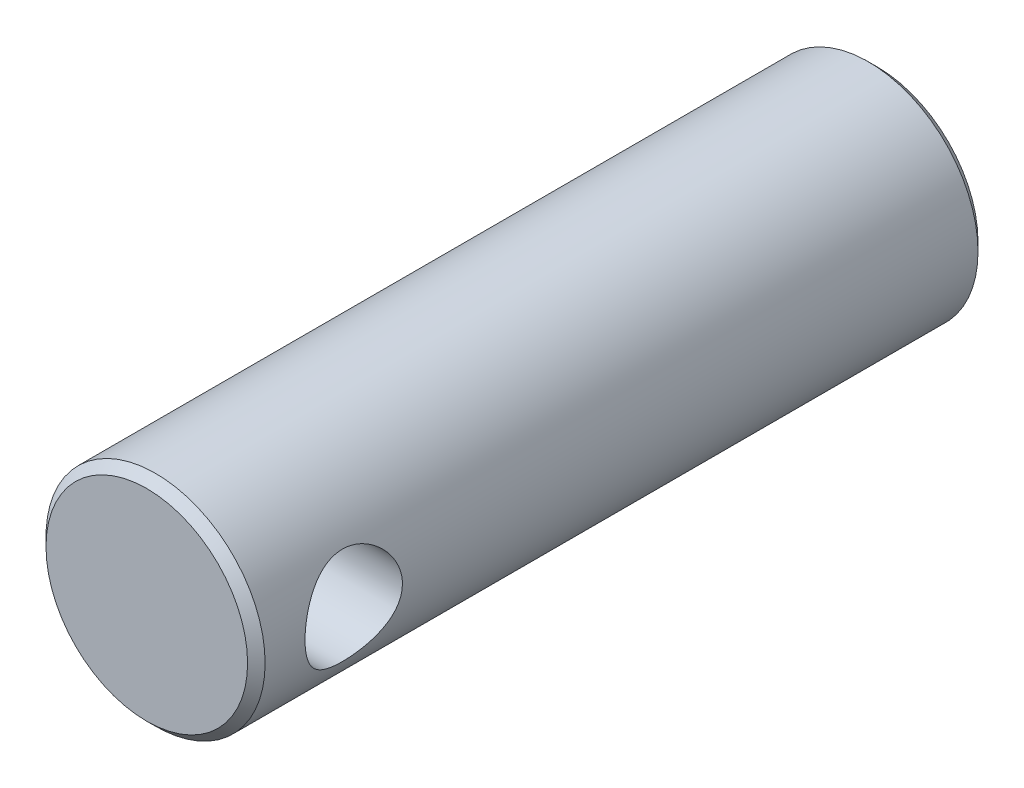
ISO-10303-21;
HEADER;
FILE_DESCRIPTION(('STEP AP214'),'2;1');
FILE_NAME('part.step','',(''),(''),'','','');
FILE_SCHEMA(('AUTOMOTIVE_DESIGN { 1 0 10303 214 1 1 1 1 }'));
ENDSEC;
DATA;
#1=APPLICATION_CONTEXT('core data for automotive mechanical design processes');
#2=APPLICATION_PROTOCOL_DEFINITION('international standard','automotive_design',2000,#1);
#3=PRODUCT_CONTEXT('',#1,'mechanical');
#4=PRODUCT('Part','Part','',(#3));
#5=PRODUCT_RELATED_PRODUCT_CATEGORY('part','',(#4));
#6=PRODUCT_DEFINITION_FORMATION('','',#4);
#7=PRODUCT_DEFINITION_CONTEXT('part definition',#1,'design');
#8=PRODUCT_DEFINITION('design','',#6,#7);
#9=PRODUCT_DEFINITION_SHAPE('','',#8);
#10=(LENGTH_UNIT() NAMED_UNIT(*) SI_UNIT(.MILLI.,.METRE.));
#11=(NAMED_UNIT(*) PLANE_ANGLE_UNIT() SI_UNIT($,.RADIAN.));
#12=(NAMED_UNIT(*) SI_UNIT($,.STERADIAN.) SOLID_ANGLE_UNIT());
#13=UNCERTAINTY_MEASURE_WITH_UNIT(LENGTH_MEASURE(1.E-05),#10,'distance_accuracy_value','');
#14=(GEOMETRIC_REPRESENTATION_CONTEXT(3) GLOBAL_UNCERTAINTY_ASSIGNED_CONTEXT((#13)) GLOBAL_UNIT_ASSIGNED_CONTEXT((#10,
#11,#12)) REPRESENTATION_CONTEXT('',''));
#15=CARTESIAN_POINT('',(0.,0.,0.));
#16=DIRECTION('',(0.,0.,1.));
#17=DIRECTION('',(1.,0.,0.));
#18=AXIS2_PLACEMENT_3D('',#15,#16,#17);
#19=CARTESIAN_POINT('',(0.,0.,0.));
#20=DIRECTION('',(0.,0.,-1.));
#21=DIRECTION('',(1.,0.,0.));
#22=AXIS2_PLACEMENT_3D('',#19,#20,#21);
#23=CYLINDRICAL_SURFACE('',#22,9.);
#24=CARTESIAN_POINT('',(9.,0.,56.));
#25=CARTESIAN_POINT('',(8.99999931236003,0.106543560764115,55.9999991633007));
#26=CARTESIAN_POINT('',(8.99810295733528,0.213114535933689,55.995737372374));
#27=CARTESIAN_POINT('',(8.99056534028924,0.425487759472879,55.9787335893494));
#28=CARTESIAN_POINT('',(8.9849219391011,0.531289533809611,55.9659867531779));
#29=CARTESIAN_POINT('',(8.97002203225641,0.741497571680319,55.9321151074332));
#30=CARTESIAN_POINT('',(8.96075877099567,0.845900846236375,55.9109746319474));
#31=CARTESIAN_POINT('',(8.93886560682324,1.0523739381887,55.8605472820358));
#32=CARTESIAN_POINT('',(8.92623432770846,1.15444278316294,55.8312570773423));
#33=CARTESIAN_POINT('',(8.88385509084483,1.45528706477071,55.731826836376));
#34=CARTESIAN_POINT('',(8.84954694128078,1.64969223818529,55.6499645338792));
#35=CARTESIAN_POINT('',(8.77205693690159,2.02169397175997,55.457842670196));
#36=CARTESIAN_POINT('',(8.72887710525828,2.19929435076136,55.3475895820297));
#37=CARTESIAN_POINT('',(8.63520005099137,2.54295194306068,55.095329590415));
#38=CARTESIAN_POINT('',(8.58444255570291,2.70796463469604,54.951994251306));
#39=CARTESIAN_POINT('',(8.48237167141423,3.01251193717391,54.6405139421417));
#40=CARTESIAN_POINT('',(8.43105797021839,3.15203136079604,54.4723542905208));
#41=CARTESIAN_POINT('',(8.33031613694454,3.40970641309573,54.1040790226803));
#42=CARTESIAN_POINT('',(8.28116793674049,3.52616342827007,53.9026789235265));
#43=CARTESIAN_POINT('',(8.21620901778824,3.67379855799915,53.5864416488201));
#44=CARTESIAN_POINT('',(8.1960107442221,3.71851343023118,53.478630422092));
#45=CARTESIAN_POINT('',(8.15924882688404,3.79849956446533,53.2589808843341));
#46=CARTESIAN_POINT('',(8.14268322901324,3.83377590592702,53.147144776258));
#47=CARTESIAN_POINT('',(8.11458487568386,3.89288163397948,52.9262099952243));
#48=CARTESIAN_POINT('',(8.1028347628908,3.91721191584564,52.8172725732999));
#49=CARTESIAN_POINT('',(8.08362129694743,3.95670961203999,52.5974216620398));
#50=CARTESIAN_POINT('',(8.07615587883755,3.9718814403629,52.4865091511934));
#51=CARTESIAN_POINT('',(8.06579894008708,3.99287182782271,52.2636277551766));
#52=CARTESIAN_POINT('',(8.06290582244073,3.99869365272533,52.1516592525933));
#53=CARTESIAN_POINT('',(8.06180452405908,4.00091360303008,51.9276108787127));
#54=CARTESIAN_POINT('',(8.06359604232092,3.99731233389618,51.8155310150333));
#55=CARTESIAN_POINT('',(8.07142338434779,3.98148137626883,51.6022728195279));
#56=CARTESIAN_POINT('',(8.07706352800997,3.9700557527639,51.5010195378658));
#57=CARTESIAN_POINT('',(8.09197245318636,3.9395760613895,51.2999289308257));
#58=CARTESIAN_POINT('',(8.10124240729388,3.92051952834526,51.2000920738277));
#59=CARTESIAN_POINT('',(8.13408651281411,3.85217674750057,50.9037623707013));
#60=CARTESIAN_POINT('',(8.16270181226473,3.79170447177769,50.7102821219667));
#61=CARTESIAN_POINT('',(8.23081734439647,3.64150006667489,50.332101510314));
#62=CARTESIAN_POINT('',(8.2705474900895,3.55114161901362,50.1476957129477));
#63=CARTESIAN_POINT('',(8.35638151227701,3.34416344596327,49.7958565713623));
#64=CARTESIAN_POINT('',(8.40248806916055,3.22753266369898,49.6284304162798));
#65=CARTESIAN_POINT('',(8.50133279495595,2.95801583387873,49.2981702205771));
#66=CARTESIAN_POINT('',(8.55427944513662,2.80270476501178,49.1373723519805));
#67=CARTESIAN_POINT('',(8.65709798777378,2.46687651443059,48.8433658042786));
#68=CARTESIAN_POINT('',(8.70696894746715,2.28635173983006,48.7101654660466));
#69=CARTESIAN_POINT('',(8.79984898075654,1.89830549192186,48.4715733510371));
#70=CARTESIAN_POINT('',(8.84261183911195,1.69014406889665,48.3671192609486));
#71=CARTESIAN_POINT('',(8.91451161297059,1.25681485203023,48.1954461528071));
#72=CARTESIAN_POINT('',(8.94365711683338,1.03165788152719,48.1282036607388));
#73=CARTESIAN_POINT('',(8.98336516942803,0.587641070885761,48.0373762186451));
#74=CARTESIAN_POINT('',(8.99508492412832,0.369442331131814,48.0110665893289));
#75=CARTESIAN_POINT('',(9.00240007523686,-0.0685540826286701,47.994593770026));
#76=CARTESIAN_POINT('',(8.9980009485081,-0.288351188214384,48.0044183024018));
#77=CARTESIAN_POINT('',(8.97430591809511,-0.709814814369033,48.0580870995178));
#78=CARTESIAN_POINT('',(8.95589038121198,-0.911792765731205,48.0999216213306));
#79=CARTESIAN_POINT('',(8.90701082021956,-1.30558421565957,48.2135161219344));
#80=CARTESIAN_POINT('',(8.87654533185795,-1.49739647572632,48.2852797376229));
#81=CARTESIAN_POINT('',(8.80524764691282,-1.87220783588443,48.4589771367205));
#82=CARTESIAN_POINT('',(8.76412168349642,-2.05474529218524,48.5617823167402));
#83=CARTESIAN_POINT('',(8.67576208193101,-2.40063957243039,48.7937052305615));
#84=CARTESIAN_POINT('',(8.62852578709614,-2.56398799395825,48.9228344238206));
#85=CARTESIAN_POINT('',(8.52825739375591,-2.8807303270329,49.2158239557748));
#86=CARTESIAN_POINT('',(8.4750650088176,-3.03226090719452,49.3816446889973));
#87=CARTESIAN_POINT('',(8.37207677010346,-3.30602071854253,49.7371478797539));
#88=CARTESIAN_POINT('',(8.32228212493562,-3.42823956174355,49.9268387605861));
#89=CARTESIAN_POINT('',(8.2540407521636,-3.5880743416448,50.228245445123));
#90=CARTESIAN_POINT('',(8.23214803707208,-3.63788387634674,50.3328797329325));
#91=CARTESIAN_POINT('',(8.19154569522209,-3.7284099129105,50.5465889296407));
#92=CARTESIAN_POINT('',(8.17283464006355,-3.76913049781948,50.6556618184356));
#93=CARTESIAN_POINT('',(8.13929816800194,-3.84101557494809,50.8774217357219));
#94=CARTESIAN_POINT('',(8.1244705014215,-3.87218560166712,50.9901066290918));
#95=CARTESIAN_POINT('',(8.09927719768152,-3.92460929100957,51.2182490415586));
#96=CARTESIAN_POINT('',(8.08891105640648,-3.94586407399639,51.3337062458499));
#97=CARTESIAN_POINT('',(8.07374935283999,-3.9767877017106,51.5564793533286));
#98=CARTESIAN_POINT('',(8.06855529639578,-3.98728755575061,51.6636534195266));
#99=CARTESIAN_POINT('',(8.06245450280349,-3.99960939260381,51.8786598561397));
#100=CARTESIAN_POINT('',(8.06154919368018,-4.00142848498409,51.9864924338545));
#101=CARTESIAN_POINT('',(8.06406616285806,-3.99635429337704,52.2018440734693));
#102=CARTESIAN_POINT('',(8.06748593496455,-3.98946605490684,52.309363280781));
#103=CARTESIAN_POINT('',(8.07851431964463,-3.96708318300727,52.5232976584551));
#104=CARTESIAN_POINT('',(8.08612450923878,-3.95158530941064,52.6297123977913));
#105=CARTESIAN_POINT('',(8.11370655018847,-3.89481025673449,52.9332533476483));
#106=CARTESIAN_POINT('',(8.13866591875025,-3.84284512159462,53.1280439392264));
#107=CARTESIAN_POINT('',(8.19957700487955,-3.71108221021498,53.5059989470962));
#108=CARTESIAN_POINT('',(8.23553189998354,-3.63127638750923,53.6891599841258));
#109=CARTESIAN_POINT('',(8.31722161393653,-3.4402432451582,54.0516647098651));
#110=CARTESIAN_POINT('',(8.36343549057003,-3.32733013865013,54.2300116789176));
#111=CARTESIAN_POINT('',(8.45929191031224,-3.07546946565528,54.5662532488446));
#112=CARTESIAN_POINT('',(8.50893588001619,-2.93651102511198,54.7241392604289));
#113=CARTESIAN_POINT('',(8.61126362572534,-2.622172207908,55.0292405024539));
#114=CARTESIAN_POINT('',(8.66383343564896,-2.44466910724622,55.1743141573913));
#115=CARTESIAN_POINT('',(8.76186799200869,-2.0658662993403,55.4328842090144));
#116=CARTESIAN_POINT('',(8.80732948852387,-1.86455578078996,55.546366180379));
#117=CARTESIAN_POINT('',(8.86614466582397,-1.55009155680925,55.6892195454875));
#118=CARTESIAN_POINT('',(8.88411858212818,-1.44376115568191,55.732125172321));
#119=CARTESIAN_POINT('',(8.91658812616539,-1.22735110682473,55.8087739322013));
#120=CARTESIAN_POINT('',(8.93108542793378,-1.11727329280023,55.8425214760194));
#121=CARTESIAN_POINT('',(8.95614098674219,-0.894475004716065,55.9004023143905));
#122=CARTESIAN_POINT('',(8.96670865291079,-0.781761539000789,55.9245585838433));
#123=CARTESIAN_POINT('',(8.9836293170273,-0.554414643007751,55.963066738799));
#124=CARTESIAN_POINT('',(8.98998524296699,-0.4397826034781,55.9774254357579));
#125=CARTESIAN_POINT('',(8.99608997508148,-0.270722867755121,55.9911961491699));
#126=CARTESIAN_POINT('',(8.99755504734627,-0.216644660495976,55.994496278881));
#127=CARTESIAN_POINT('',(8.99951024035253,-0.108380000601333,55.9988984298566));
#128=CARTESIAN_POINT('',(9.00000034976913,-0.0541935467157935,56.0000004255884));
#129=CARTESIAN_POINT('',(9.,0.,56.));
#130=B_SPLINE_CURVE_WITH_KNOTS('',3,(#24,#25,#26,#27,#28,#29,#30,#31,#32,#33,#34,#35,#36,#37,
#38,#39,#40,#41,#42,#43,#44,#45,#46,#47,#48,#49,#50,#51,#52,#53,#54,#55,#56,#57,#58,#59,#60,#61,
#62,#63,#64,#65,#66,#67,#68,#69,#70,#71,#72,#73,#74,#75,#76,#77,#78,#79,#80,#81,#82,#83,#84,#85,
#86,#87,#88,#89,#90,#91,#92,#93,#94,#95,#96,#97,#98,#99,#100,#101,#102,#103,#104,#105,#106,#107,
#108,#109,#110,#111,#112,#113,#114,#115,#116,#117,#118,#119,#120,#121,#122,#123,#124,#125,#126,
#127,#128,#129),.UNSPECIFIED.,.T.,.F.,(4,2,2,2,2,2,2,2,2,2,2,2,2,2,2,2,2,2,2,2,2,2,2,2,2,2,2,2,
2,2,2,2,2,2,2,2,2,2,2,2,2,2,2,2,2,2,2,2,2,2,2,2,4),(0.,0.319575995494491,0.639334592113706,
0.959692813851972,1.28018213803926,1.91817504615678,2.55602262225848,3.22626867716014,
3.89691272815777,4.60627839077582,4.9612246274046,5.31597945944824,5.65223953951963,
5.98833742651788,6.32431789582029,6.66027677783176,6.96605959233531,7.27194127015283,
7.88320420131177,8.50818797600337,9.13343527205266,9.81959120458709,10.5059542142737,
11.2125921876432,11.9187838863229,12.5755805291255,13.2321540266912,13.8505799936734,
14.4690811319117,15.1068781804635,15.7449534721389,16.4344546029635,17.1241997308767,
17.4776093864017,17.8308599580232,18.1839054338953,18.5369110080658,18.8599212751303,
19.183039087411,19.5059697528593,19.8290220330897,20.4355356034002,21.042224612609,
21.6877902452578,22.3336260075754,23.0359566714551,23.7386075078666,24.0863996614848,
24.4340240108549,24.7808105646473,25.1273557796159,25.2899067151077,25.4524595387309),.UNSPECIFIED.);
#131=CARTESIAN_POINT('',(9.,0.,56.));
#132=VERTEX_POINT('',#131);
#133=EDGE_CURVE('E30',#132,#132,#130,.T.);
#134=ORIENTED_EDGE('',*,*,#133,.T.);
#135=EDGE_LOOP('',(#134));
#136=FACE_BOUND('',#135,.T.);
#137=CARTESIAN_POINT('',(-9.,0.,56.));
#138=CARTESIAN_POINT('',(-8.99999931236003,-0.106543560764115,55.9999991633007));
#139=CARTESIAN_POINT('',(-8.99810295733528,-0.213114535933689,55.995737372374));
#140=CARTESIAN_POINT('',(-8.99056534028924,-0.425487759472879,55.9787335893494));
#141=CARTESIAN_POINT('',(-8.9849219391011,-0.531289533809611,55.9659867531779));
#142=CARTESIAN_POINT('',(-8.97002203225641,-0.741497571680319,55.9321151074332));
#143=CARTESIAN_POINT('',(-8.96075877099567,-0.845900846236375,55.9109746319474));
#144=CARTESIAN_POINT('',(-8.93886560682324,-1.0523739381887,55.8605472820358));
#145=CARTESIAN_POINT('',(-8.92623432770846,-1.15444278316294,55.8312570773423));
#146=CARTESIAN_POINT('',(-8.88385509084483,-1.45528706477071,55.731826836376));
#147=CARTESIAN_POINT('',(-8.84954694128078,-1.64969223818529,55.6499645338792));
#148=CARTESIAN_POINT('',(-8.77205693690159,-2.02169397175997,55.457842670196));
#149=CARTESIAN_POINT('',(-8.72887710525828,-2.19929435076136,55.3475895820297));
#150=CARTESIAN_POINT('',(-8.63520005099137,-2.54295194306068,55.095329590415));
#151=CARTESIAN_POINT('',(-8.58444255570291,-2.70796463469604,54.951994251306));
#152=CARTESIAN_POINT('',(-8.48237167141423,-3.01251193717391,54.6405139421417));
#153=CARTESIAN_POINT('',(-8.43105797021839,-3.15203136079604,54.4723542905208));
#154=CARTESIAN_POINT('',(-8.33031613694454,-3.40970641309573,54.1040790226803));
#155=CARTESIAN_POINT('',(-8.28116793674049,-3.52616342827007,53.9026789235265));
#156=CARTESIAN_POINT('',(-8.21620901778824,-3.67379855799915,53.5864416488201));
#157=CARTESIAN_POINT('',(-8.1960107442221,-3.71851343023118,53.478630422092));
#158=CARTESIAN_POINT('',(-8.15924882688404,-3.79849956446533,53.2589808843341));
#159=CARTESIAN_POINT('',(-8.14268322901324,-3.83377590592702,53.147144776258));
#160=CARTESIAN_POINT('',(-8.11458487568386,-3.89288163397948,52.9262099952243));
#161=CARTESIAN_POINT('',(-8.1028347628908,-3.91721191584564,52.8172725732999));
#162=CARTESIAN_POINT('',(-8.08362129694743,-3.95670961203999,52.5974216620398));
#163=CARTESIAN_POINT('',(-8.07615587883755,-3.9718814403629,52.4865091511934));
#164=CARTESIAN_POINT('',(-8.06579894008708,-3.99287182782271,52.2636277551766));
#165=CARTESIAN_POINT('',(-8.06290582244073,-3.99869365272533,52.1516592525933));
#166=CARTESIAN_POINT('',(-8.06180452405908,-4.00091360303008,51.9276108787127));
#167=CARTESIAN_POINT('',(-8.06359604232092,-3.99731233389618,51.8155310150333));
#168=CARTESIAN_POINT('',(-8.07142338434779,-3.98148137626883,51.6022728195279));
#169=CARTESIAN_POINT('',(-8.07706352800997,-3.9700557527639,51.5010195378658));
#170=CARTESIAN_POINT('',(-8.09197245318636,-3.9395760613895,51.2999289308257));
#171=CARTESIAN_POINT('',(-8.10124240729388,-3.92051952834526,51.2000920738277));
#172=CARTESIAN_POINT('',(-8.13408651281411,-3.85217674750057,50.9037623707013));
#173=CARTESIAN_POINT('',(-8.16270181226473,-3.79170447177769,50.7102821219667));
#174=CARTESIAN_POINT('',(-8.23081734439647,-3.64150006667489,50.332101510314));
#175=CARTESIAN_POINT('',(-8.2705474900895,-3.55114161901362,50.1476957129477));
#176=CARTESIAN_POINT('',(-8.35638151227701,-3.34416344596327,49.7958565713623));
#177=CARTESIAN_POINT('',(-8.40248806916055,-3.22753266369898,49.6284304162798));
#178=CARTESIAN_POINT('',(-8.50133279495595,-2.95801583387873,49.2981702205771));
#179=CARTESIAN_POINT('',(-8.55427944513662,-2.80270476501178,49.1373723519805));
#180=CARTESIAN_POINT('',(-8.65709798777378,-2.46687651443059,48.8433658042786));
#181=CARTESIAN_POINT('',(-8.70696894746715,-2.28635173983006,48.7101654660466));
#182=CARTESIAN_POINT('',(-8.79984898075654,-1.89830549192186,48.4715733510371));
#183=CARTESIAN_POINT('',(-8.84261183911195,-1.69014406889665,48.3671192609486));
#184=CARTESIAN_POINT('',(-8.91451161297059,-1.25681485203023,48.1954461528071));
#185=CARTESIAN_POINT('',(-8.94365711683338,-1.03165788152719,48.1282036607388));
#186=CARTESIAN_POINT('',(-8.98336516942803,-0.587641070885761,48.0373762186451));
#187=CARTESIAN_POINT('',(-8.99508492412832,-0.369442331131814,48.0110665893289));
#188=CARTESIAN_POINT('',(-9.00240007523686,0.0685540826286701,47.994593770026));
#189=CARTESIAN_POINT('',(-8.9980009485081,0.288351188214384,48.0044183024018));
#190=CARTESIAN_POINT('',(-8.97430591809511,0.709814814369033,48.0580870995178));
#191=CARTESIAN_POINT('',(-8.95589038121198,0.911792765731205,48.0999216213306));
#192=CARTESIAN_POINT('',(-8.90701082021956,1.30558421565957,48.2135161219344));
#193=CARTESIAN_POINT('',(-8.87654533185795,1.49739647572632,48.2852797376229));
#194=CARTESIAN_POINT('',(-8.80524764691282,1.87220783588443,48.4589771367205));
#195=CARTESIAN_POINT('',(-8.76412168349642,2.05474529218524,48.5617823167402));
#196=CARTESIAN_POINT('',(-8.67576208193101,2.40063957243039,48.7937052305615));
#197=CARTESIAN_POINT('',(-8.62852578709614,2.56398799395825,48.9228344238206));
#198=CARTESIAN_POINT('',(-8.52825739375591,2.8807303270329,49.2158239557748));
#199=CARTESIAN_POINT('',(-8.4750650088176,3.03226090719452,49.3816446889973));
#200=CARTESIAN_POINT('',(-8.37207677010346,3.30602071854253,49.7371478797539));
#201=CARTESIAN_POINT('',(-8.32228212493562,3.42823956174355,49.9268387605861));
#202=CARTESIAN_POINT('',(-8.2540407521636,3.5880743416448,50.228245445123));
#203=CARTESIAN_POINT('',(-8.23214803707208,3.63788387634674,50.3328797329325));
#204=CARTESIAN_POINT('',(-8.19154569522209,3.7284099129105,50.5465889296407));
#205=CARTESIAN_POINT('',(-8.17283464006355,3.76913049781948,50.6556618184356));
#206=CARTESIAN_POINT('',(-8.13929816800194,3.84101557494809,50.8774217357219));
#207=CARTESIAN_POINT('',(-8.1244705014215,3.87218560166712,50.9901066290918));
#208=CARTESIAN_POINT('',(-8.09927719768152,3.92460929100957,51.2182490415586));
#209=CARTESIAN_POINT('',(-8.08891105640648,3.94586407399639,51.3337062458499));
#210=CARTESIAN_POINT('',(-8.07374935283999,3.9767877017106,51.5564793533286));
#211=CARTESIAN_POINT('',(-8.06855529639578,3.98728755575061,51.6636534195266));
#212=CARTESIAN_POINT('',(-8.06245450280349,3.99960939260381,51.8786598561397));
#213=CARTESIAN_POINT('',(-8.06154919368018,4.00142848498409,51.9864924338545));
#214=CARTESIAN_POINT('',(-8.06406616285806,3.99635429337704,52.2018440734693));
#215=CARTESIAN_POINT('',(-8.06748593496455,3.98946605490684,52.309363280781));
#216=CARTESIAN_POINT('',(-8.07851431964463,3.96708318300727,52.5232976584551));
#217=CARTESIAN_POINT('',(-8.08612450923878,3.95158530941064,52.6297123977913));
#218=CARTESIAN_POINT('',(-8.11370655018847,3.89481025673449,52.9332533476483));
#219=CARTESIAN_POINT('',(-8.13866591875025,3.84284512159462,53.1280439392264));
#220=CARTESIAN_POINT('',(-8.19957700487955,3.71108221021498,53.5059989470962));
#221=CARTESIAN_POINT('',(-8.23553189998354,3.63127638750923,53.6891599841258));
#222=CARTESIAN_POINT('',(-8.31722161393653,3.4402432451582,54.0516647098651));
#223=CARTESIAN_POINT('',(-8.36343549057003,3.32733013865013,54.2300116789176));
#224=CARTESIAN_POINT('',(-8.45929191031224,3.07546946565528,54.5662532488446));
#225=CARTESIAN_POINT('',(-8.50893588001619,2.93651102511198,54.7241392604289));
#226=CARTESIAN_POINT('',(-8.61126362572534,2.622172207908,55.0292405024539));
#227=CARTESIAN_POINT('',(-8.66383343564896,2.44466910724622,55.1743141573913));
#228=CARTESIAN_POINT('',(-8.76186799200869,2.0658662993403,55.4328842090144));
#229=CARTESIAN_POINT('',(-8.80732948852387,1.86455578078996,55.546366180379));
#230=CARTESIAN_POINT('',(-8.86614466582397,1.55009155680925,55.6892195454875));
#231=CARTESIAN_POINT('',(-8.88411858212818,1.44376115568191,55.732125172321));
#232=CARTESIAN_POINT('',(-8.91658812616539,1.22735110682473,55.8087739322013));
#233=CARTESIAN_POINT('',(-8.93108542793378,1.11727329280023,55.8425214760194));
#234=CARTESIAN_POINT('',(-8.95614098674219,0.894475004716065,55.9004023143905));
#235=CARTESIAN_POINT('',(-8.96670865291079,0.781761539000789,55.9245585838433));
#236=CARTESIAN_POINT('',(-8.9836293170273,0.554414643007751,55.963066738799));
#237=CARTESIAN_POINT('',(-8.98998524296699,0.4397826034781,55.9774254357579));
#238=CARTESIAN_POINT('',(-8.99608997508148,0.270722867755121,55.9911961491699));
#239=CARTESIAN_POINT('',(-8.99755504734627,0.216644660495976,55.994496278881));
#240=CARTESIAN_POINT('',(-8.99951024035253,0.108380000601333,55.9988984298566));
#241=CARTESIAN_POINT('',(-9.00000034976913,0.0541935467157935,56.0000004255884));
#242=CARTESIAN_POINT('',(-9.,0.,56.));
#243=B_SPLINE_CURVE_WITH_KNOTS('',3,(#137,#138,#139,#140,#141,#142,#143,#144,#145,#146,#147,
#148,#149,#150,#151,#152,#153,#154,#155,#156,#157,#158,#159,#160,#161,#162,#163,#164,#165,#166,
#167,#168,#169,#170,#171,#172,#173,#174,#175,#176,#177,#178,#179,#180,#181,#182,#183,#184,#185,
#186,#187,#188,#189,#190,#191,#192,#193,#194,#195,#196,#197,#198,#199,#200,#201,#202,#203,#204,
#205,#206,#207,#208,#209,#210,#211,#212,#213,#214,#215,#216,#217,#218,#219,#220,#221,#222,#223,
#224,#225,#226,#227,#228,#229,#230,#231,#232,#233,#234,#235,#236,#237,#238,#239,#240,#241,#242),
.UNSPECIFIED.,.T.,.F.,(4,2,2,2,2,2,2,2,2,2,2,2,2,2,2,2,2,2,2,2,2,2,2,2,2,2,2,2,2,2,2,2,2,2,2,2,
2,2,2,2,2,2,2,2,2,2,2,2,2,2,2,2,4),(0.,0.319575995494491,0.639334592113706,0.959692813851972,
1.28018213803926,1.91817504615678,2.55602262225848,3.22626867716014,3.89691272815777,
4.60627839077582,4.9612246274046,5.31597945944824,5.65223953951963,5.98833742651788,
6.32431789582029,6.66027677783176,6.96605959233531,7.27194127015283,7.88320420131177,
8.50818797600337,9.13343527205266,9.81959120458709,10.5059542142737,11.2125921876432,
11.9187838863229,12.5755805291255,13.2321540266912,13.8505799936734,14.4690811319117,
15.1068781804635,15.7449534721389,16.4344546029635,17.1241997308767,17.4776093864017,
17.8308599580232,18.1839054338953,18.5369110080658,18.8599212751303,19.183039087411,
19.5059697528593,19.8290220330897,20.4355356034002,21.042224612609,21.6877902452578,
22.3336260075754,23.0359566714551,23.7386075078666,24.0863996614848,24.4340240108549,
24.7808105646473,25.1273557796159,25.2899067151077,25.4524595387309),.UNSPECIFIED.);
#244=CARTESIAN_POINT('',(-9.,0.,56.));
#245=VERTEX_POINT('',#244);
#246=EDGE_CURVE('E39',#245,#245,#243,.T.);
#247=ORIENTED_EDGE('',*,*,#246,.T.);
#248=EDGE_LOOP('',(#247));
#249=FACE_BOUND('',#248,.T.);
#250=CARTESIAN_POINT('',(0.,0.,0.72));
#251=DIRECTION('',(0.,0.,-1.));
#252=DIRECTION('',(1.,0.,0.));
#253=AXIS2_PLACEMENT_3D('',#250,#251,#252);
#254=CIRCLE('',#253,9.);
#255=CARTESIAN_POINT('',(9.,0.,0.72));
#256=VERTEX_POINT('',#255);
#257=EDGE_CURVE('E83',#256,#256,#254,.T.);
#258=ORIENTED_EDGE('',*,*,#257,.F.);
#259=EDGE_LOOP('',(#258));
#260=FACE_BOUND('',#259,.T.);
#261=CARTESIAN_POINT('',(0.,0.,59.28));
#262=DIRECTION('',(0.,0.,-1.));
#263=DIRECTION('',(1.,0.,0.));
#264=AXIS2_PLACEMENT_3D('',#261,#262,#263);
#265=CIRCLE('',#264,9.);
#266=CARTESIAN_POINT('',(9.,0.,59.28));
#267=VERTEX_POINT('',#266);
#268=EDGE_CURVE('E27',#267,#267,#265,.T.);
#269=ORIENTED_EDGE('',*,*,#268,.T.);
#270=EDGE_LOOP('',(#269));
#271=FACE_BOUND('',#270,.T.);
#272=ADVANCED_FACE('F12',(#136,#249,#260,#271),#23,.T.);
#273=CARTESIAN_POINT('',(0.,-8.28,0.));
#274=DIRECTION('',(0.,0.,1.));
#275=DIRECTION('',(-1.,0.,0.));
#276=AXIS2_PLACEMENT_3D('',#273,#274,#275);
#277=PLANE('',#276);
#278=CARTESIAN_POINT('',(0.,0.,0.));
#279=DIRECTION('',(0.,0.,1.));
#280=DIRECTION('',(0.,-1.,0.));
#281=AXIS2_PLACEMENT_3D('',#278,#279,#280);
#282=CIRCLE('',#281,5.65);
#283=CARTESIAN_POINT('',(0.,-5.65,0.));
#284=VERTEX_POINT('',#283);
#285=EDGE_CURVE('E8',#284,#284,#282,.T.);
#286=ORIENTED_EDGE('',*,*,#285,.T.);
#287=EDGE_LOOP('',(#286));
#288=FACE_BOUND('',#287,.T.);
#289=CARTESIAN_POINT('',(0.,0.,0.));
#290=DIRECTION('',(0.,0.,-1.));
#291=DIRECTION('',(1.,0.,0.));
#292=AXIS2_PLACEMENT_3D('',#289,#290,#291);
#293=CIRCLE('',#292,8.28);
#294=CARTESIAN_POINT('',(8.28,0.,0.));
#295=VERTEX_POINT('',#294);
#296=EDGE_CURVE('E38',#295,#295,#293,.T.);
#297=ORIENTED_EDGE('',*,*,#296,.T.);
#298=EDGE_LOOP('',(#297));
#299=FACE_BOUND('',#298,.T.);
#300=ADVANCED_FACE('F55',(#288,#299),#277,.F.);
#301=CARTESIAN_POINT('',(0.,0.,60.));
#302=DIRECTION('',(0.,0.,-1.));
#303=DIRECTION('',(1.,0.,0.));
#304=AXIS2_PLACEMENT_3D('',#301,#302,#303);
#305=PLANE('',#304);
#306=CARTESIAN_POINT('',(0.,0.,60.));
#307=DIRECTION('',(0.,0.,-1.));
#308=DIRECTION('',(1.,0.,0.));
#309=AXIS2_PLACEMENT_3D('',#306,#307,#308);
#310=CIRCLE('',#309,8.28);
#311=CARTESIAN_POINT('',(8.28,0.,60.));
#312=VERTEX_POINT('',#311);
#313=EDGE_CURVE('E23',#312,#312,#310,.T.);
#314=ORIENTED_EDGE('',*,*,#313,.F.);
#315=EDGE_LOOP('',(#314));
#316=FACE_BOUND('',#315,.T.);
#317=ADVANCED_FACE('F58',(#316),#305,.F.);
#318=CARTESIAN_POINT('',(0.,0.,60.));
#319=DIRECTION('',(0.,0.,-1.));
#320=DIRECTION('',(1.,0.,0.));
#321=AXIS2_PLACEMENT_3D('',#318,#319,#320);
#322=CONICAL_SURFACE('',#321,8.28,0.78539816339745);
#323=ORIENTED_EDGE('',*,*,#268,.F.);
#324=EDGE_LOOP('',(#323));
#325=FACE_BOUND('',#324,.T.);
#326=ORIENTED_EDGE('',*,*,#313,.T.);
#327=EDGE_LOOP('',(#326));
#328=FACE_BOUND('',#327,.T.);
#329=ADVANCED_FACE('F60',(#325,#328),#322,.T.);
#330=CARTESIAN_POINT('',(0.,0.,0.72));
#331=DIRECTION('',(0.,0.,1.));
#332=DIRECTION('',(-1.,0.,0.));
#333=AXIS2_PLACEMENT_3D('',#330,#331,#332);
#334=CONICAL_SURFACE('',#333,9.,0.78539816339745);
#335=ORIENTED_EDGE('',*,*,#296,.F.);
#336=EDGE_LOOP('',(#335));
#337=FACE_BOUND('',#336,.T.);
#338=ORIENTED_EDGE('',*,*,#257,.T.);
#339=EDGE_LOOP('',(#338));
#340=FACE_BOUND('',#339,.T.);
#341=ADVANCED_FACE('F52',(#337,#340),#334,.T.);
#342=CARTESIAN_POINT('',(-10.,0.,52.));
#343=DIRECTION('',(1.,0.,0.));
#344=DIRECTION('',(0.,0.,1.));
#345=AXIS2_PLACEMENT_3D('',#342,#343,#344);
#346=CYLINDRICAL_SURFACE('',#345,4.);
#347=ORIENTED_EDGE('',*,*,#246,.F.);
#348=EDGE_LOOP('',(#347));
#349=FACE_BOUND('',#348,.T.);
#350=ORIENTED_EDGE('',*,*,#133,.F.);
#351=EDGE_LOOP('',(#350));
#352=FACE_BOUND('',#351,.T.);
#353=ADVANCED_FACE('F46',(#349,#352),#346,.F.);
#354=CARTESIAN_POINT('',(0.,0.,20.));
#355=DIRECTION('',(0.,0.,-1.));
#356=DIRECTION('',(0.,1.,0.));
#357=AXIS2_PLACEMENT_3D('',#354,#355,#356);
#358=CYLINDRICAL_SURFACE('',#357,5.);
#359=CARTESIAN_POINT('',(0.,0.,0.65));
#360=DIRECTION('',(0.,0.,1.));
#361=DIRECTION('',(0.,-1.,0.));
#362=AXIS2_PLACEMENT_3D('',#359,#360,#361);
#363=CIRCLE('',#362,5.);
#364=CARTESIAN_POINT('',(0.,-5.,0.65));
#365=VERTEX_POINT('',#364);
#366=EDGE_CURVE('E19',#365,#365,#363,.F.);
#367=ORIENTED_EDGE('',*,*,#366,.T.);
#368=EDGE_LOOP('',(#367));
#369=FACE_BOUND('',#368,.T.);
#370=CARTESIAN_POINT('',(0.,0.,20.));
#371=DIRECTION('',(0.,0.,-1.));
#372=DIRECTION('',(0.,1.,0.));
#373=AXIS2_PLACEMENT_3D('',#370,#371,#372);
#374=CIRCLE('',#373,5.);
#375=CARTESIAN_POINT('',(0.,5.,20.));
#376=VERTEX_POINT('',#375);
#377=EDGE_CURVE('E91',#376,#376,#374,.T.);
#378=ORIENTED_EDGE('',*,*,#377,.F.);
#379=EDGE_LOOP('',(#378));
#380=FACE_BOUND('',#379,.T.);
#381=ADVANCED_FACE('F51',(#369,#380),#358,.F.);
#382=CARTESIAN_POINT('',(0.,0.,20.));
#383=DIRECTION('',(0.,0.,-1.));
#384=DIRECTION('',(0.,1.,0.));
#385=AXIS2_PLACEMENT_3D('',#382,#383,#384);
#386=PLANE('',#385);
#387=ORIENTED_EDGE('',*,*,#377,.T.);
#388=EDGE_LOOP('',(#387));
#389=FACE_BOUND('',#388,.T.);
#390=ADVANCED_FACE('F95',(#389),#386,.T.);
#391=CARTESIAN_POINT('',(0.,0.,0.65));
#392=DIRECTION('',(0.,0.,-1.));
#393=DIRECTION('',(0.,1.,0.));
#394=AXIS2_PLACEMENT_3D('',#391,#392,#393);
#395=CONICAL_SURFACE('',#394,5.,0.785398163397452);
#396=ORIENTED_EDGE('',*,*,#285,.F.);
#397=EDGE_LOOP('',(#396));
#398=FACE_BOUND('',#397,.T.);
#399=ORIENTED_EDGE('',*,*,#366,.F.);
#400=EDGE_LOOP('',(#399));
#401=FACE_BOUND('',#400,.T.);
#402=ADVANCED_FACE('F14',(#398,#401),#395,.F.);
#403=CLOSED_SHELL('',(#272,#300,#317,#329,#341,#353,#381,#390,#402));
#404=MANIFOLD_SOLID_BREP('B1',#403);
#405=ADVANCED_BREP_SHAPE_REPRESENTATION('',(#18,#404),#14);
#406=SHAPE_DEFINITION_REPRESENTATION(#9,#405);
ENDSEC;
END-ISO-10303-21;
